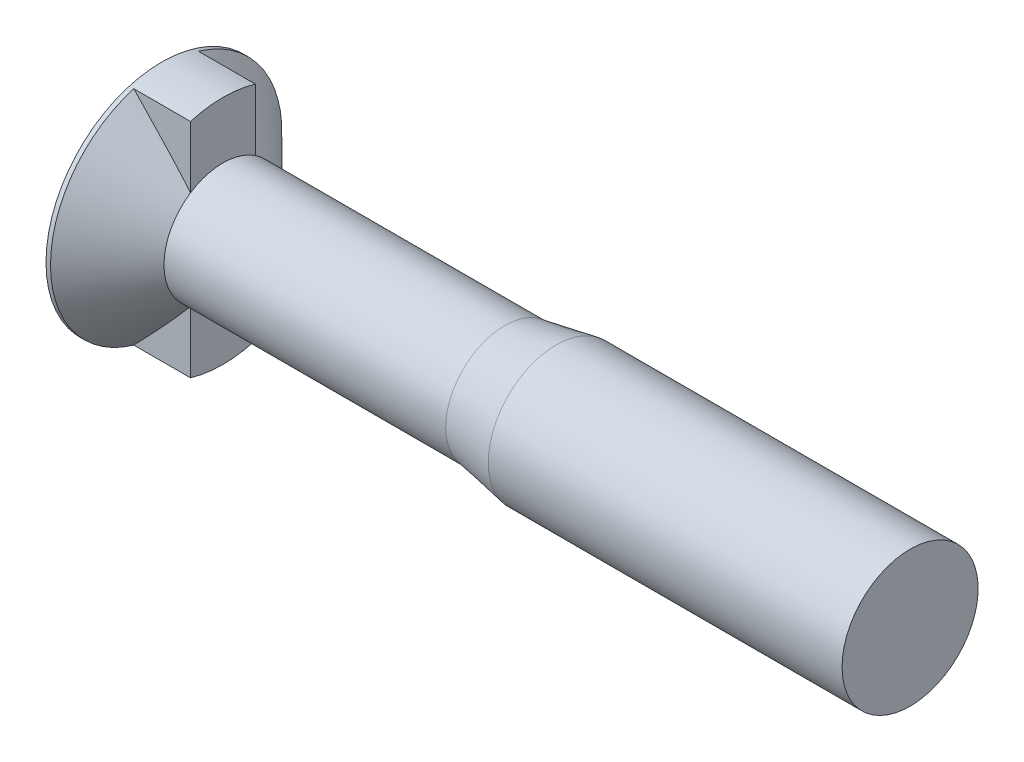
from build123d import *

# Parameters (mm, degrees)
SKETCH3_W          = 4.5
SKETCH3_H          = 17
NIB_DEPTH          = 2.38
SKETCH4_OUTSIDE_W  = 31.004
SKETCH4_OUTSIDE_H  = 31.004
SKETCH4_OUTSIDE_R  = 8.5
CUT_EXTRUDE1_DEPTH = 57.298312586


with BuildPart() as part:
    # Sketch2 → Base (revolve)
    with BuildSketch(Plane.XY, mode=Mode.PRIVATE) as base_sk:
        Polygon((0, 0), (0, 8.5), (0.329957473, 8.5), (4.5, 4.329957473), (25.2, 4.329957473), (29, 5), (55, 5), (55, 0), align=None)
    revolve(base_sk.sketch.rotate(Axis((-4.940548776, 0, 0), (1, 0, 0)), 90), axis=Axis((-4.940548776, 0, 0), (1, 0, 0)))

    # Sketch3 → Nib (add, symmetric)
    with BuildSketch(Plane.XY):
        with Locations((2.25, 0)):
            Rectangle(SKETCH3_W, SKETCH3_H)
    extrude(amount=NIB_DEPTH, both=True)

    # Sketch4 outside → Cut-Extrude1 (cut, through all)
    with BuildSketch(Plane.ZY):
        Rectangle(SKETCH4_OUTSIDE_W, SKETCH4_OUTSIDE_H)
        Circle(SKETCH4_OUTSIDE_R, mode=Mode.SUBTRACT)
    extrude(amount=-CUT_EXTRUDE1_DEPTH, mode=Mode.SUBTRACT)


solid = part.part
